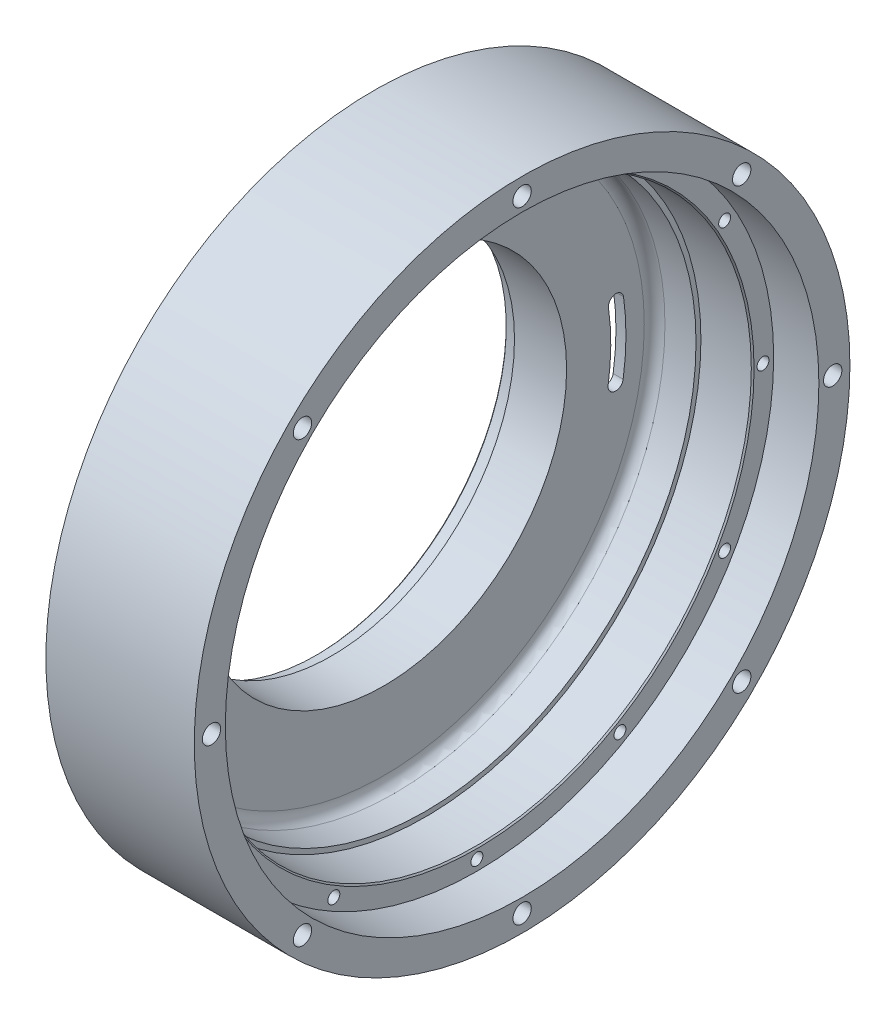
from build123d import *

# Parameters (mm, degrees)
SKETCH1_R           = 120.65
BOSS_EXTRUDE1_DEPTH = 54.61
SKETCH2_R           = 67.31
CUT_EXTRUDE1_DEPTH  = 180.15104549
SKETCH3_R           = 99.695
CUT_EXTRUDE2_DEPTH  = 50.927
SKETCH4_R           = 101.4984
CUT_EXTRUDE3_DEPTH  = 35.687
SKETCH5_R           = 109.22
CUT_EXTRUDE4_DEPTH  = 16.637
CIRPATTERN1_COUNT   = 12
SKETCH10_R          = 76.2
BOSS_EXTRUDE2_DEPTH = 21.59
SKETCH11_R          = 67.31
CUT_EXTRUDE5_DEPTH  = 187.867024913
SKETCH12_R          = 69.8627
CUT_EXTRUDE6_DEPTH  = 6.096
CIRPATTERN2_COUNT   = 8
CUT_EXTRUDE7_DEPTH  = 180.15104549
CIRPATTERN3_COUNT   = 8
CIRPATTERN4_COUNT   = 8
FILLET3_R           = 3.81
CHAMFER1_SIZE       = 0.508
CHAMFER2_SIZE       = 0.508


with BuildPart() as part:
    # Sketch1 → Boss-Extrude1 (new body)
    with BuildSketch(Plane(origin=(0, 0, 0), x_dir=(0, 0, -1), z_dir=(1, 0, 0))):
        Circle(SKETCH1_R)
    extrude(amount=BOSS_EXTRUDE1_DEPTH)

    # Sketch2 → Cut-Extrude1 (cut, through all)
    with BuildSketch(Plane(origin=(54.61, 0, 0), x_dir=(0, 0, -1), z_dir=(1, 0, 0))):
        Circle(SKETCH2_R)
    extrude(amount=-CUT_EXTRUDE1_DEPTH, mode=Mode.SUBTRACT)

    # Sketch3 → Cut-Extrude2 (cut)
    with BuildSketch(Plane(origin=(54.61, 0, 0), x_dir=(0, 0, -1), z_dir=(1, 0, 0))):
        Circle(SKETCH3_R)
    extrude(amount=-CUT_EXTRUDE2_DEPTH, mode=Mode.SUBTRACT)

    # Sketch4 → Cut-Extrude3 (cut)
    with BuildSketch(Plane(origin=(54.61, 0, 0), x_dir=(0, 0, -1), z_dir=(1, 0, 0))):
        Circle(SKETCH4_R)
    extrude(amount=-CUT_EXTRUDE3_DEPTH, mode=Mode.SUBTRACT)

    # Sketch5 → Cut-Extrude4 (cut)
    with BuildSketch(Plane(origin=(54.61, 0, 0), x_dir=(0, 0, -1), z_dir=(1, 0, 0))):
        Circle(SKETCH5_R)
    extrude(amount=-CUT_EXTRUDE4_DEPTH, mode=Mode.SUBTRACT)

    # Sketch9 → Tapped Hole for _8-32 Helicoil1 (revolve, cut)
    with BuildSketch(Plane(origin=(37.973, 105.283, 0), x_dir=(0, 0, -1), z_dir=(0, 1, 0))):
        Polygon((0, 0), (0, 16.839550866), (2.1971, 15.5194), (2.1971, 0), align=None)
    tapped_hole_for_8_32_helicoil1 = revolve(axis=Axis((44.323, 105.283, 0), (-1, 0, 0)), mode=Mode.SUBTRACT)

    # CirPattern1: Tapped Hole for _8-32 Helicoil1 ×12 about axis
    cirpattern1_axis = Axis((0, 0, 0), (1, 0, 0))
    for i in range(1, CIRPATTERN1_COUNT):
        add(tapped_hole_for_8_32_helicoil1.rotate(cirpattern1_axis, i * 360 / CIRPATTERN1_COUNT), mode=Mode.SUBTRACT)

    # Sketch10 → Boss-Extrude2 (add)
    with BuildSketch(Plane.ZY):
        with Locations(Location((0, 0, 0), (0, 0, 180))):
            Circle(SKETCH10_R)
    extrude(amount=BOSS_EXTRUDE2_DEPTH)

    # Sketch11 → Cut-Extrude5 (cut, through all)
    with BuildSketch(Plane.ZY.offset(21.59)):
        with Locations(Location((0, 0, 0), (0, 0, 180))):
            Circle(SKETCH11_R)
    extrude(amount=-CUT_EXTRUDE5_DEPTH, mode=Mode.SUBTRACT)

    # Sketch12 → Cut-Extrude6 (cut)
    with BuildSketch(Plane.ZY.offset(21.59)):
        Circle(SKETCH12_R)
    extrude(amount=-CUT_EXTRUDE6_DEPTH, mode=Mode.SUBTRACT)

    # Sketch14 → Tapped Hole for _8-32 Helicoil2 (revolve, cut)
    with BuildSketch(Plane(origin=(-21.59, 72.898, 0), x_dir=(0, 0, 1), z_dir=(0, 1, 0))):
        Polygon((0, 0), (0, 16.839550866), (2.1971, 15.5194), (2.1971, 0), align=None)
    tapped_hole_for_8_32_helicoil2 = revolve(axis=Axis((-27.94, 72.898, 0), (1, 0, 0)), mode=Mode.SUBTRACT)

    # CirPattern2: Tapped Hole for _8-32 Helicoil2 ×8 about axis
    cirpattern2_axis = Axis((0, 0, 0), (1, 0, 0))
    for i in range(1, CIRPATTERN2_COUNT):
        add(tapped_hole_for_8_32_helicoil2.rotate(cirpattern2_axis, i * 360 / CIRPATTERN2_COUNT), mode=Mode.SUBTRACT)

    # Sketch16 → Cut-Extrude7 (cut, through all)
    with BuildSketch(Plane.ZY):
        with BuildLine():
            ThreePointArc((-88.253516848, 12.639322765), (-89.152725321, -0.476743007), (-88.113296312, -13.582441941))
            ThreePointArc((-88.113296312, -13.582441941), (-84.926250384, -15.918166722), (-82.590525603, -12.731120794))
            ThreePointArc((-82.590525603, -12.731120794), (-83.564805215, -0.446861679), (-82.721957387, 11.8471145))
            ThreePointArc((-82.721957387, 11.8471145), (-85.091632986, 15.008998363), (-88.253516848, 12.639322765))
        make_face()
    extrude(amount=-CUT_EXTRUDE7_DEPTH, mode=Mode.SUBTRACT)

    # Sketch18 → Tapped Hole for 1_4-20 Helicoil1 (revolve, cut)
    with BuildSketch(Plane(origin=(54.61, 0, -114.3), x_dir=(0, 0, -1), z_dir=(0, 1, 0))):
        Polygon((0, 0), (0, 25.931227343), (3.3782, 23.9014), (3.3782, 0), align=None)
    tapped_hole_for_1_4_20_helicoil1 = revolve(axis=Axis((60.96, 0, -114.3), (-1, 0, 0)), mode=Mode.SUBTRACT)

    # CirPattern3: Tapped Hole for 1_4-20 Helicoil1 ×8 about axis
    cirpattern3_axis = Axis((0, 0, 0), (1, 0, 0))
    for i in range(1, CIRPATTERN3_COUNT):
        add(tapped_hole_for_1_4_20_helicoil1.rotate(cirpattern3_axis, i * 360 / CIRPATTERN3_COUNT), mode=Mode.SUBTRACT)

    # Sketch20 → Tapped Hole for 1_4-20 Helicoil2 (revolve, cut)
    with BuildSketch(Plane(origin=(0, 0, -114.3), x_dir=(0, 0, 1), z_dir=(0, 1, 0))):
        Polygon((0, 0), (0, 25.931227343), (3.3782, 23.9014), (3.3782, 0), align=None)
    tapped_hole_for_1_4_20_helicoil2 = revolve(axis=Axis((-6.35, 0, -114.3), (1, 0, 0)), mode=Mode.SUBTRACT)

    # CirPattern4: Tapped Hole for 1_4-20 Helicoil2 ×8 about axis
    cirpattern4_axis = Axis((0, 0, 0), (1, 0, 0))
    for i in range(1, CIRPATTERN4_COUNT):
        add(tapped_hole_for_1_4_20_helicoil2.rotate(cirpattern4_axis, i * 360 / CIRPATTERN4_COUNT), mode=Mode.SUBTRACT)

    # Fillet3
    fillet3_edges = [part.edges().sort_by_distance(p)[0] for p in [
        (3.683, 0, 99.695),
    ]]
    fillet(fillet3_edges, radius=FILLET3_R)

    # Chamfer1
    chamfer1_edges = [part.edges().sort_by_distance(p)[0] for p in [
        (-21.59, 0, -69.8627),
    ]]
    chamfer(chamfer1_edges, length=CHAMFER1_SIZE)

    # Chamfer2
    chamfer2_edges = [part.edges().sort_by_distance(p)[0] for p in [
        (37.973, 0, 101.4984),
    ]]
    chamfer(chamfer2_edges, length=CHAMFER2_SIZE)


solid = part.part
